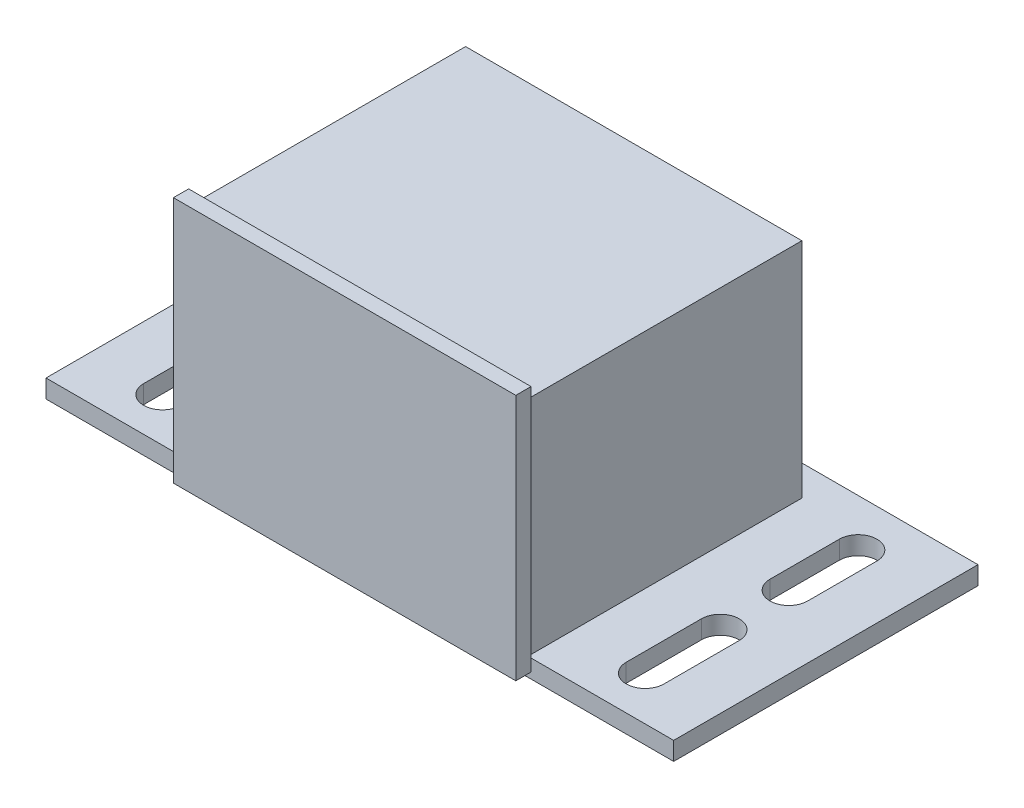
ISO-10303-21;
HEADER;
FILE_DESCRIPTION(('STEP AP214'),'2;1');
FILE_NAME('part.step','',(''),(''),'','','');
FILE_SCHEMA(('AUTOMOTIVE_DESIGN { 1 0 10303 214 1 1 1 1 }'));
ENDSEC;
DATA;
#1=APPLICATION_CONTEXT('core data for automotive mechanical design processes');
#2=APPLICATION_PROTOCOL_DEFINITION('international standard','automotive_design',2000,#1);
#3=PRODUCT_CONTEXT('',#1,'mechanical');
#4=PRODUCT('Part','Part','',(#3));
#5=PRODUCT_RELATED_PRODUCT_CATEGORY('part','',(#4));
#6=PRODUCT_DEFINITION_FORMATION('','',#4);
#7=PRODUCT_DEFINITION_CONTEXT('part definition',#1,'design');
#8=PRODUCT_DEFINITION('design','',#6,#7);
#9=PRODUCT_DEFINITION_SHAPE('','',#8);
#10=(LENGTH_UNIT() NAMED_UNIT(*) SI_UNIT(.MILLI.,.METRE.));
#11=(NAMED_UNIT(*) PLANE_ANGLE_UNIT() SI_UNIT($,.RADIAN.));
#12=(NAMED_UNIT(*) SI_UNIT($,.STERADIAN.) SOLID_ANGLE_UNIT());
#13=UNCERTAINTY_MEASURE_WITH_UNIT(LENGTH_MEASURE(1.E-05),#10,'distance_accuracy_value','');
#14=(GEOMETRIC_REPRESENTATION_CONTEXT(3) GLOBAL_UNCERTAINTY_ASSIGNED_CONTEXT((#13)) GLOBAL_UNIT_ASSIGNED_CONTEXT((#10,
#11,#12)) REPRESENTATION_CONTEXT('',''));
#15=CARTESIAN_POINT('',(0.,0.,0.));
#16=DIRECTION('',(0.,0.,1.));
#17=DIRECTION('',(1.,0.,0.));
#18=AXIS2_PLACEMENT_3D('',#15,#16,#17);
#19=CARTESIAN_POINT('',(0.,1.524,0.));
#20=DIRECTION('',(0.,-1.,0.));
#21=DIRECTION('',(0.,0.,-1.));
#22=AXIS2_PLACEMENT_3D('',#19,#20,#21);
#23=PLANE('',#22);
#24=CARTESIAN_POINT('',(20.1379240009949,1.524,-8.75426625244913));
#25=DIRECTION('',(0.,-1.,0.));
#26=DIRECTION('',(0.,0.,1.));
#27=AXIS2_PLACEMENT_3D('',#24,#25,#26);
#28=CIRCLE('',#27,1.5748);
#29=CARTESIAN_POINT('',(18.5631240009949,1.524,-8.75426625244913));
#30=VERTEX_POINT('',#29);
#31=CARTESIAN_POINT('',(21.7127240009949,1.524,-8.75426625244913));
#32=VERTEX_POINT('',#31);
#33=EDGE_CURVE('E257',#30,#32,#28,.T.);
#34=ORIENTED_EDGE('',*,*,#33,.T.);
#35=DIRECTION('',(0.,0.,1.));
#36=VECTOR('',#35,1.);
#37=CARTESIAN_POINT('',(21.7127240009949,1.524,-8.75426625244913));
#38=LINE('',#37,#36);
#39=CARTESIAN_POINT('',(21.7127240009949,1.524,-2.9652548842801));
#40=VERTEX_POINT('',#39);
#41=EDGE_CURVE('E264',#32,#40,#38,.T.);
#42=ORIENTED_EDGE('',*,*,#41,.T.);
#43=CARTESIAN_POINT('',(20.1379240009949,1.524,-2.9652548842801));
#44=DIRECTION('',(0.,-1.,0.));
#45=DIRECTION('',(0.,0.,1.));
#46=AXIS2_PLACEMENT_3D('',#43,#44,#45);
#47=CIRCLE('',#46,1.5748);
#48=CARTESIAN_POINT('',(18.5631240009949,1.524,-2.9652548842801));
#49=VERTEX_POINT('',#48);
#50=EDGE_CURVE('E277',#40,#49,#47,.T.);
#51=ORIENTED_EDGE('',*,*,#50,.T.);
#52=DIRECTION('',(0.,0.,-1.));
#53=VECTOR('',#52,1.);
#54=CARTESIAN_POINT('',(18.5631240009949,1.524,-8.75426625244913));
#55=LINE('',#54,#53);
#56=EDGE_CURVE('E274',#49,#30,#55,.T.);
#57=ORIENTED_EDGE('',*,*,#56,.T.);
#58=EDGE_LOOP('',(#34,#42,#51,#57));
#59=FACE_BOUND('',#58,.T.);
#60=DIRECTION('',(0.,0.,1.));
#61=VECTOR('',#60,1.);
#62=CARTESIAN_POINT('',(-21.7127240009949,1.524,2.7497451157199));
#63=LINE('',#62,#61);
#64=CARTESIAN_POINT('',(-21.7127240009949,1.524,2.7497451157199));
#65=VERTEX_POINT('',#64);
#66=CARTESIAN_POINT('',(-21.7127240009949,1.524,9.02822906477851));
#67=VERTEX_POINT('',#66);
#68=EDGE_CURVE('E307',#65,#67,#63,.T.);
#69=ORIENTED_EDGE('',*,*,#68,.F.);
#70=CARTESIAN_POINT('',(-20.1379240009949,1.524,2.7497451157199));
#71=DIRECTION('',(0.,1.,0.));
#72=DIRECTION('',(0.,0.,1.));
#73=AXIS2_PLACEMENT_3D('',#70,#71,#72);
#74=CIRCLE('',#73,1.5748);
#75=CARTESIAN_POINT('',(-18.5631240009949,1.524,2.7497451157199));
#76=VERTEX_POINT('',#75);
#77=EDGE_CURVE('E285',#76,#65,#74,.T.);
#78=ORIENTED_EDGE('',*,*,#77,.F.);
#79=DIRECTION('',(0.,0.,-1.));
#80=VECTOR('',#79,1.);
#81=CARTESIAN_POINT('',(-18.5631240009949,1.524,2.7497451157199));
#82=LINE('',#81,#80);
#83=CARTESIAN_POINT('',(-18.5631240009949,1.524,9.02822906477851));
#84=VERTEX_POINT('',#83);
#85=EDGE_CURVE('E296',#84,#76,#82,.T.);
#86=ORIENTED_EDGE('',*,*,#85,.F.);
#87=CARTESIAN_POINT('',(-20.1379240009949,1.524,9.02822906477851));
#88=DIRECTION('',(0.,1.,0.));
#89=DIRECTION('',(0.,0.,1.));
#90=AXIS2_PLACEMENT_3D('',#87,#88,#89);
#91=CIRCLE('',#90,1.5748);
#92=EDGE_CURVE('E310',#67,#84,#91,.T.);
#93=ORIENTED_EDGE('',*,*,#92,.F.);
#94=EDGE_LOOP('',(#69,#78,#86,#93));
#95=FACE_BOUND('',#94,.T.);
#96=DIRECTION('',(0.,0.,1.));
#97=VECTOR('',#96,1.);
#98=CARTESIAN_POINT('',(-21.7127240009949,1.524,-8.75426625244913));
#99=LINE('',#98,#97);
#100=CARTESIAN_POINT('',(-21.7127240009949,1.524,-8.75426625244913));
#101=VERTEX_POINT('',#100);
#102=CARTESIAN_POINT('',(-21.7127240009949,1.524,-2.9652548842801));
#103=VERTEX_POINT('',#102);
#104=EDGE_CURVE('E339',#101,#103,#99,.T.);
#105=ORIENTED_EDGE('',*,*,#104,.F.);
#106=CARTESIAN_POINT('',(-20.1379240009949,1.524,-8.75426625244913));
#107=DIRECTION('',(0.,1.,0.));
#108=DIRECTION('',(0.,0.,1.));
#109=AXIS2_PLACEMENT_3D('',#106,#107,#108);
#110=CIRCLE('',#109,1.5748);
#111=CARTESIAN_POINT('',(-18.5631240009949,1.524,-8.75426625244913));
#112=VERTEX_POINT('',#111);
#113=EDGE_CURVE('E317',#112,#101,#110,.T.);
#114=ORIENTED_EDGE('',*,*,#113,.F.);
#115=DIRECTION('',(0.,0.,-1.));
#116=VECTOR('',#115,1.);
#117=CARTESIAN_POINT('',(-18.5631240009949,1.524,-8.75426625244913));
#118=LINE('',#117,#116);
#119=CARTESIAN_POINT('',(-18.5631240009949,1.524,-2.9652548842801));
#120=VERTEX_POINT('',#119);
#121=EDGE_CURVE('E328',#120,#112,#118,.T.);
#122=ORIENTED_EDGE('',*,*,#121,.F.);
#123=CARTESIAN_POINT('',(-20.1379240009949,1.524,-2.9652548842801));
#124=DIRECTION('',(0.,1.,0.));
#125=DIRECTION('',(0.,0.,1.));
#126=AXIS2_PLACEMENT_3D('',#123,#124,#125);
#127=CIRCLE('',#126,1.5748);
#128=EDGE_CURVE('E342',#103,#120,#127,.T.);
#129=ORIENTED_EDGE('',*,*,#128,.F.);
#130=EDGE_LOOP('',(#105,#114,#122,#129));
#131=FACE_BOUND('',#130,.T.);
#132=DIRECTION('',(1.,0.,0.));
#133=VECTOR('',#132,1.);
#134=CARTESIAN_POINT('',(-26.19375,1.524,12.7));
#135=LINE('',#134,#133);
#136=CARTESIAN_POINT('',(-26.19375,1.524,12.7));
#137=VERTEX_POINT('',#136);
#138=CARTESIAN_POINT('',(-14.2875,1.524,12.7));
#139=VERTEX_POINT('',#138);
#140=EDGE_CURVE('E423',#137,#139,#135,.T.);
#141=ORIENTED_EDGE('',*,*,#140,.T.);
#142=CARTESIAN_POINT('',(-14.0335,1.524,12.7));
#143=VERTEX_POINT('',#142);
#144=EDGE_CURVE('E427',#139,#143,#135,.T.);
#145=ORIENTED_EDGE('',*,*,#144,.T.);
#146=DIRECTION('',(0.,0.,-1.));
#147=VECTOR('',#146,1.);
#148=CARTESIAN_POINT('',(-14.0335,1.524,0.));
#149=LINE('',#148,#147);
#150=CARTESIAN_POINT('',(-14.0335,1.524,-10.16));
#151=VERTEX_POINT('',#150);
#152=EDGE_CURVE('E411',#143,#151,#149,.T.);
#153=ORIENTED_EDGE('',*,*,#152,.T.);
#154=DIRECTION('',(1.,0.,0.));
#155=VECTOR('',#154,1.);
#156=CARTESIAN_POINT('',(0.,1.524,-10.16));
#157=LINE('',#156,#155);
#158=CARTESIAN_POINT('',(14.0335,1.524,-10.16));
#159=VERTEX_POINT('',#158);
#160=EDGE_CURVE('E406',#151,#159,#157,.T.);
#161=ORIENTED_EDGE('',*,*,#160,.T.);
#162=DIRECTION('',(0.,0.,1.));
#163=VECTOR('',#162,1.);
#164=CARTESIAN_POINT('',(14.0335,1.524,0.));
#165=LINE('',#164,#163);
#166=CARTESIAN_POINT('',(14.0335,1.524,12.7));
#167=VERTEX_POINT('',#166);
#168=EDGE_CURVE('E409',#159,#167,#165,.T.);
#169=ORIENTED_EDGE('',*,*,#168,.T.);
#170=CARTESIAN_POINT('',(14.2875,1.524,12.7));
#171=VERTEX_POINT('',#170);
#172=EDGE_CURVE('E428',#167,#171,#135,.T.);
#173=ORIENTED_EDGE('',*,*,#172,.T.);
#174=CARTESIAN_POINT('',(26.19375,1.524,12.7));
#175=VERTEX_POINT('',#174);
#176=EDGE_CURVE('E422',#171,#175,#135,.T.);
#177=ORIENTED_EDGE('',*,*,#176,.T.);
#178=DIRECTION('',(0.,0.,-1.));
#179=VECTOR('',#178,1.);
#180=CARTESIAN_POINT('',(26.19375,1.524,12.7));
#181=LINE('',#180,#179);
#182=CARTESIAN_POINT('',(26.19375,1.524,-12.7));
#183=VERTEX_POINT('',#182);
#184=EDGE_CURVE('E414',#175,#183,#181,.T.);
#185=ORIENTED_EDGE('',*,*,#184,.T.);
#186=DIRECTION('',(-1.,0.,0.));
#187=VECTOR('',#186,1.);
#188=CARTESIAN_POINT('',(-26.19375,1.524,-12.7));
#189=LINE('',#188,#187);
#190=CARTESIAN_POINT('',(-26.19375,1.524,-12.7));
#191=VERTEX_POINT('',#190);
#192=EDGE_CURVE('E417',#183,#191,#189,.T.);
#193=ORIENTED_EDGE('',*,*,#192,.T.);
#194=DIRECTION('',(0.,0.,1.));
#195=VECTOR('',#194,1.);
#196=CARTESIAN_POINT('',(-26.19375,1.524,12.7));
#197=LINE('',#196,#195);
#198=EDGE_CURVE('E420',#191,#137,#197,.T.);
#199=ORIENTED_EDGE('',*,*,#198,.T.);
#200=EDGE_LOOP('',(#141,#145,#153,#161,#169,#173,#177,#185,#193,#199));
#201=FACE_BOUND('',#200,.T.);
#202=CARTESIAN_POINT('',(20.1379240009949,1.524,2.7497451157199));
#203=DIRECTION('',(0.,-1.,0.));
#204=DIRECTION('',(0.,0.,1.));
#205=AXIS2_PLACEMENT_3D('',#202,#203,#204);
#206=CIRCLE('',#205,1.5748);
#207=CARTESIAN_POINT('',(18.5631240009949,1.524,2.7497451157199));
#208=VERTEX_POINT('',#207);
#209=CARTESIAN_POINT('',(21.7127240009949,1.524,2.7497451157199));
#210=VERTEX_POINT('',#209);
#211=EDGE_CURVE('E50',#208,#210,#206,.T.);
#212=ORIENTED_EDGE('',*,*,#211,.T.);
#213=DIRECTION('',(0.,0.,1.));
#214=VECTOR('',#213,1.);
#215=CARTESIAN_POINT('',(21.7127240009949,1.524,2.7497451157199));
#216=LINE('',#215,#214);
#217=CARTESIAN_POINT('',(21.7127240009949,1.524,9.02822906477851));
#218=VERTEX_POINT('',#217);
#219=EDGE_CURVE('E242',#210,#218,#216,.T.);
#220=ORIENTED_EDGE('',*,*,#219,.T.);
#221=CARTESIAN_POINT('',(20.1379240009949,1.524,9.02822906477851));
#222=DIRECTION('',(0.,-1.,0.));
#223=DIRECTION('',(0.,0.,1.));
#224=AXIS2_PLACEMENT_3D('',#221,#222,#223);
#225=CIRCLE('',#224,1.5748);
#226=CARTESIAN_POINT('',(18.5631240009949,1.524,9.02822906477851));
#227=VERTEX_POINT('',#226);
#228=EDGE_CURVE('E245',#218,#227,#225,.T.);
#229=ORIENTED_EDGE('',*,*,#228,.T.);
#230=DIRECTION('',(0.,0.,-1.));
#231=VECTOR('',#230,1.);
#232=CARTESIAN_POINT('',(18.5631240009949,1.524,2.7497451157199));
#233=LINE('',#232,#231);
#234=EDGE_CURVE('E251',#227,#208,#233,.T.);
#235=ORIENTED_EDGE('',*,*,#234,.T.);
#236=EDGE_LOOP('',(#212,#220,#229,#235));
#237=FACE_BOUND('',#236,.T.);
#238=ADVANCED_FACE('F33',(#59,#95,#131,#201,#237),#23,.F.);
#239=CARTESIAN_POINT('',(0.,0.,0.));
#240=DIRECTION('',(0.,-1.,0.));
#241=DIRECTION('',(0.,0.,-1.));
#242=AXIS2_PLACEMENT_3D('',#239,#240,#241);
#243=PLANE('',#242);
#244=CARTESIAN_POINT('',(-20.1379240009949,0.,2.7497451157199));
#245=DIRECTION('',(0.,1.,0.));
#246=DIRECTION('',(0.,0.,1.));
#247=AXIS2_PLACEMENT_3D('',#244,#245,#246);
#248=CIRCLE('',#247,1.5748);
#249=CARTESIAN_POINT('',(-18.5631240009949,0.,2.7497451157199));
#250=VERTEX_POINT('',#249);
#251=CARTESIAN_POINT('',(-21.7127240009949,0.,2.7497451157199));
#252=VERTEX_POINT('',#251);
#253=EDGE_CURVE('E292',#250,#252,#248,.T.);
#254=ORIENTED_EDGE('',*,*,#253,.T.);
#255=DIRECTION('',(0.,0.,1.));
#256=VECTOR('',#255,1.);
#257=CARTESIAN_POINT('',(-21.7127240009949,0.,2.7497451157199));
#258=LINE('',#257,#256);
#259=CARTESIAN_POINT('',(-21.7127240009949,0.,9.02822906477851));
#260=VERTEX_POINT('',#259);
#261=EDGE_CURVE('E295',#252,#260,#258,.T.);
#262=ORIENTED_EDGE('',*,*,#261,.T.);
#263=CARTESIAN_POINT('',(-20.1379240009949,0.,9.02822906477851));
#264=DIRECTION('',(0.,1.,0.));
#265=DIRECTION('',(0.,0.,1.));
#266=AXIS2_PLACEMENT_3D('',#263,#264,#265);
#267=CIRCLE('',#266,1.5748);
#268=CARTESIAN_POINT('',(-18.5631240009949,0.,9.02822906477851));
#269=VERTEX_POINT('',#268);
#270=EDGE_CURVE('E299',#260,#269,#267,.T.);
#271=ORIENTED_EDGE('',*,*,#270,.T.);
#272=DIRECTION('',(0.,0.,-1.));
#273=VECTOR('',#272,1.);
#274=CARTESIAN_POINT('',(-18.5631240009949,0.,2.7497451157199));
#275=LINE('',#274,#273);
#276=EDGE_CURVE('E302',#269,#250,#275,.T.);
#277=ORIENTED_EDGE('',*,*,#276,.T.);
#278=EDGE_LOOP('',(#254,#262,#271,#277));
#279=FACE_BOUND('',#278,.T.);
#280=CARTESIAN_POINT('',(-20.1379240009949,0.,-8.75426625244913));
#281=DIRECTION('',(0.,1.,0.));
#282=DIRECTION('',(0.,0.,1.));
#283=AXIS2_PLACEMENT_3D('',#280,#281,#282);
#284=CIRCLE('',#283,1.5748);
#285=CARTESIAN_POINT('',(-18.5631240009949,0.,-8.75426625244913));
#286=VERTEX_POINT('',#285);
#287=CARTESIAN_POINT('',(-21.7127240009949,0.,-8.75426625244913));
#288=VERTEX_POINT('',#287);
#289=EDGE_CURVE('E324',#286,#288,#284,.T.);
#290=ORIENTED_EDGE('',*,*,#289,.T.);
#291=DIRECTION('',(0.,0.,1.));
#292=VECTOR('',#291,1.);
#293=CARTESIAN_POINT('',(-21.7127240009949,0.,-8.75426625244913));
#294=LINE('',#293,#292);
#295=CARTESIAN_POINT('',(-21.7127240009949,0.,-2.9652548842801));
#296=VERTEX_POINT('',#295);
#297=EDGE_CURVE('E327',#288,#296,#294,.T.);
#298=ORIENTED_EDGE('',*,*,#297,.T.);
#299=CARTESIAN_POINT('',(-20.1379240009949,0.,-2.9652548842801));
#300=DIRECTION('',(0.,1.,0.));
#301=DIRECTION('',(0.,0.,1.));
#302=AXIS2_PLACEMENT_3D('',#299,#300,#301);
#303=CIRCLE('',#302,1.5748);
#304=CARTESIAN_POINT('',(-18.5631240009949,0.,-2.9652548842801));
#305=VERTEX_POINT('',#304);
#306=EDGE_CURVE('E331',#296,#305,#303,.T.);
#307=ORIENTED_EDGE('',*,*,#306,.T.);
#308=DIRECTION('',(0.,0.,-1.));
#309=VECTOR('',#308,1.);
#310=CARTESIAN_POINT('',(-18.5631240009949,0.,-8.75426625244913));
#311=LINE('',#310,#309);
#312=EDGE_CURVE('E334',#305,#286,#311,.T.);
#313=ORIENTED_EDGE('',*,*,#312,.T.);
#314=EDGE_LOOP('',(#290,#298,#307,#313));
#315=FACE_BOUND('',#314,.T.);
#316=DIRECTION('',(0.,0.,-1.));
#317=VECTOR('',#316,1.);
#318=CARTESIAN_POINT('',(26.19375,0.,12.7));
#319=LINE('',#318,#317);
#320=CARTESIAN_POINT('',(26.19375,0.,12.7));
#321=VERTEX_POINT('',#320);
#322=CARTESIAN_POINT('',(26.19375,0.,-12.7));
#323=VERTEX_POINT('',#322);
#324=EDGE_CURVE('E413',#321,#323,#319,.T.);
#325=ORIENTED_EDGE('',*,*,#324,.F.);
#326=DIRECTION('',(1.,0.,0.));
#327=VECTOR('',#326,1.);
#328=CARTESIAN_POINT('',(-26.19375,0.,12.7));
#329=LINE('',#328,#327);
#330=CARTESIAN_POINT('',(-26.19375,0.,12.7));
#331=VERTEX_POINT('',#330);
#332=EDGE_CURVE('E418',#331,#321,#329,.T.);
#333=ORIENTED_EDGE('',*,*,#332,.F.);
#334=DIRECTION('',(0.,0.,1.));
#335=VECTOR('',#334,1.);
#336=CARTESIAN_POINT('',(-26.19375,0.,12.7));
#337=LINE('',#336,#335);
#338=CARTESIAN_POINT('',(-26.19375,0.,-12.7));
#339=VERTEX_POINT('',#338);
#340=EDGE_CURVE('E433',#339,#331,#337,.T.);
#341=ORIENTED_EDGE('',*,*,#340,.F.);
#342=DIRECTION('',(-1.,0.,0.));
#343=VECTOR('',#342,1.);
#344=CARTESIAN_POINT('',(-26.19375,0.,-12.7));
#345=LINE('',#344,#343);
#346=EDGE_CURVE('E431',#323,#339,#345,.T.);
#347=ORIENTED_EDGE('',*,*,#346,.F.);
#348=EDGE_LOOP('',(#325,#333,#341,#347));
#349=FACE_BOUND('',#348,.T.);
#350=DIRECTION('',(0.,0.,1.));
#351=VECTOR('',#350,1.);
#352=CARTESIAN_POINT('',(21.7127240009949,0.,-8.75426625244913));
#353=LINE('',#352,#351);
#354=CARTESIAN_POINT('',(21.7127240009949,0.,-8.75426625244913));
#355=VERTEX_POINT('',#354);
#356=CARTESIAN_POINT('',(21.7127240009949,0.,-2.9652548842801));
#357=VERTEX_POINT('',#356);
#358=EDGE_CURVE('E269',#355,#357,#353,.T.);
#359=ORIENTED_EDGE('',*,*,#358,.F.);
#360=CARTESIAN_POINT('',(20.1379240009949,0.,-8.75426625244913));
#361=DIRECTION('',(0.,-1.,0.));
#362=DIRECTION('',(0.,0.,1.));
#363=AXIS2_PLACEMENT_3D('',#360,#361,#362);
#364=CIRCLE('',#363,1.5748);
#365=CARTESIAN_POINT('',(18.5631240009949,0.,-8.75426625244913));
#366=VERTEX_POINT('',#365);
#367=EDGE_CURVE('E261',#366,#355,#364,.T.);
#368=ORIENTED_EDGE('',*,*,#367,.F.);
#369=DIRECTION('',(0.,0.,-1.));
#370=VECTOR('',#369,1.);
#371=CARTESIAN_POINT('',(18.5631240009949,0.,-8.75426625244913));
#372=LINE('',#371,#370);
#373=CARTESIAN_POINT('',(18.5631240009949,0.,-2.9652548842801));
#374=VERTEX_POINT('',#373);
#375=EDGE_CURVE('E263',#374,#366,#372,.T.);
#376=ORIENTED_EDGE('',*,*,#375,.F.);
#377=CARTESIAN_POINT('',(20.1379240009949,0.,-2.9652548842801));
#378=DIRECTION('',(0.,-1.,0.));
#379=DIRECTION('',(0.,0.,1.));
#380=AXIS2_PLACEMENT_3D('',#377,#378,#379);
#381=CIRCLE('',#380,1.5748);
#382=EDGE_CURVE('E266',#357,#374,#381,.T.);
#383=ORIENTED_EDGE('',*,*,#382,.F.);
#384=EDGE_LOOP('',(#359,#368,#376,#383));
#385=FACE_BOUND('',#384,.T.);
#386=DIRECTION('',(0.,0.,1.));
#387=VECTOR('',#386,1.);
#388=CARTESIAN_POINT('',(21.7127240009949,0.,2.7497451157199));
#389=LINE('',#388,#387);
#390=CARTESIAN_POINT('',(21.7127240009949,0.,2.7497451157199));
#391=VERTEX_POINT('',#390);
#392=CARTESIAN_POINT('',(21.7127240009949,0.,9.02822906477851));
#393=VERTEX_POINT('',#392);
#394=EDGE_CURVE('E238',#391,#393,#389,.T.);
#395=ORIENTED_EDGE('',*,*,#394,.F.);
#396=CARTESIAN_POINT('',(20.1379240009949,0.,2.7497451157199));
#397=DIRECTION('',(0.,-1.,0.));
#398=DIRECTION('',(0.,0.,1.));
#399=AXIS2_PLACEMENT_3D('',#396,#397,#398);
#400=CIRCLE('',#399,1.5748);
#401=CARTESIAN_POINT('',(18.5631240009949,0.,2.7497451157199));
#402=VERTEX_POINT('',#401);
#403=EDGE_CURVE('E234',#402,#391,#400,.T.);
#404=ORIENTED_EDGE('',*,*,#403,.F.);
#405=DIRECTION('',(0.,0.,-1.));
#406=VECTOR('',#405,1.);
#407=CARTESIAN_POINT('',(18.5631240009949,0.,2.7497451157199));
#408=LINE('',#407,#406);
#409=CARTESIAN_POINT('',(18.5631240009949,0.,9.02822906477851));
#410=VERTEX_POINT('',#409);
#411=EDGE_CURVE('E226',#410,#402,#408,.T.);
#412=ORIENTED_EDGE('',*,*,#411,.F.);
#413=CARTESIAN_POINT('',(20.1379240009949,0.,9.02822906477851));
#414=DIRECTION('',(0.,-1.,0.));
#415=DIRECTION('',(0.,0.,1.));
#416=AXIS2_PLACEMENT_3D('',#413,#414,#415);
#417=CIRCLE('',#416,1.5748);
#418=EDGE_CURVE('E233',#393,#410,#417,.T.);
#419=ORIENTED_EDGE('',*,*,#418,.F.);
#420=EDGE_LOOP('',(#395,#404,#412,#419));
#421=FACE_BOUND('',#420,.T.);
#422=ADVANCED_FACE('F241',(#279,#315,#349,#385,#421),#243,.T.);
#423=CARTESIAN_POINT('',(-26.19375,1.524,12.7));
#424=DIRECTION('',(0.,0.,-1.));
#425=DIRECTION('',(-1.,0.,0.));
#426=AXIS2_PLACEMENT_3D('',#423,#424,#425);
#427=PLANE('',#426);
#428=DIRECTION('',(0.,-1.,0.));
#429=VECTOR('',#428,1.);
#430=CARTESIAN_POINT('',(-14.2875,21.1455,12.7));
#431=LINE('',#430,#429);
#432=CARTESIAN_POINT('',(-14.2875,0.508,12.7));
#433=VERTEX_POINT('',#432);
#434=EDGE_CURVE('E11',#139,#433,#431,.T.);
#435=ORIENTED_EDGE('',*,*,#434,.F.);
#436=ORIENTED_EDGE('',*,*,#140,.F.);
#437=DIRECTION('',(0.,-1.,0.));
#438=VECTOR('',#437,1.);
#439=CARTESIAN_POINT('',(-26.19375,1.524,12.7));
#440=LINE('',#439,#438);
#441=EDGE_CURVE('E438',#137,#331,#440,.T.);
#442=ORIENTED_EDGE('',*,*,#441,.T.);
#443=ORIENTED_EDGE('',*,*,#332,.T.);
#444=DIRECTION('',(0.,-1.,0.));
#445=VECTOR('',#444,1.);
#446=CARTESIAN_POINT('',(26.19375,1.524,12.7));
#447=LINE('',#446,#445);
#448=EDGE_CURVE('E426',#175,#321,#447,.T.);
#449=ORIENTED_EDGE('',*,*,#448,.F.);
#450=ORIENTED_EDGE('',*,*,#176,.F.);
#451=DIRECTION('',(0.,1.,0.));
#452=VECTOR('',#451,1.);
#453=CARTESIAN_POINT('',(14.2875,21.1455,12.7));
#454=LINE('',#453,#452);
#455=CARTESIAN_POINT('',(14.2875,0.508,12.7));
#456=VERTEX_POINT('',#455);
#457=EDGE_CURVE('E371',#456,#171,#454,.T.);
#458=ORIENTED_EDGE('',*,*,#457,.F.);
#459=DIRECTION('',(1.,0.,0.));
#460=VECTOR('',#459,1.);
#461=CARTESIAN_POINT('',(-14.2875,0.508,12.7));
#462=LINE('',#461,#460);
#463=EDGE_CURVE('E367',#433,#456,#462,.T.);
#464=ORIENTED_EDGE('',*,*,#463,.F.);
#465=EDGE_LOOP('',(#435,#436,#442,#443,#449,#450,#458,#464));
#466=FACE_BOUND('',#465,.T.);
#467=ADVANCED_FACE('F461',(#466),#427,.F.);
#468=CARTESIAN_POINT('',(26.19375,1.524,12.7));
#469=DIRECTION('',(-1.,0.,0.));
#470=DIRECTION('',(0.,0.,1.));
#471=AXIS2_PLACEMENT_3D('',#468,#469,#470);
#472=PLANE('',#471);
#473=ORIENTED_EDGE('',*,*,#324,.T.);
#474=DIRECTION('',(0.,-1.,0.));
#475=VECTOR('',#474,1.);
#476=CARTESIAN_POINT('',(26.19375,1.524,-12.7));
#477=LINE('',#476,#475);
#478=EDGE_CURVE('E37',#183,#323,#477,.T.);
#479=ORIENTED_EDGE('',*,*,#478,.F.);
#480=ORIENTED_EDGE('',*,*,#184,.F.);
#481=ORIENTED_EDGE('',*,*,#448,.T.);
#482=EDGE_LOOP('',(#473,#479,#480,#481));
#483=FACE_BOUND('',#482,.T.);
#484=ADVANCED_FACE('F35',(#483),#472,.F.);
#485=CARTESIAN_POINT('',(-26.19375,1.524,-12.7));
#486=DIRECTION('',(0.,0.,1.));
#487=DIRECTION('',(1.,0.,0.));
#488=AXIS2_PLACEMENT_3D('',#485,#486,#487);
#489=PLANE('',#488);
#490=ORIENTED_EDGE('',*,*,#346,.T.);
#491=DIRECTION('',(0.,-1.,0.));
#492=VECTOR('',#491,1.);
#493=CARTESIAN_POINT('',(-26.19375,1.524,-12.7));
#494=LINE('',#493,#492);
#495=EDGE_CURVE('E440',#191,#339,#494,.T.);
#496=ORIENTED_EDGE('',*,*,#495,.F.);
#497=ORIENTED_EDGE('',*,*,#192,.F.);
#498=ORIENTED_EDGE('',*,*,#478,.T.);
#499=EDGE_LOOP('',(#490,#496,#497,#498));
#500=FACE_BOUND('',#499,.T.);
#501=ADVANCED_FACE('F449',(#500),#489,.F.);
#502=CARTESIAN_POINT('',(-26.19375,1.524,12.7));
#503=DIRECTION('',(1.,0.,0.));
#504=DIRECTION('',(0.,0.,-1.));
#505=AXIS2_PLACEMENT_3D('',#502,#503,#504);
#506=PLANE('',#505);
#507=ORIENTED_EDGE('',*,*,#340,.T.);
#508=ORIENTED_EDGE('',*,*,#441,.F.);
#509=ORIENTED_EDGE('',*,*,#198,.F.);
#510=ORIENTED_EDGE('',*,*,#495,.T.);
#511=EDGE_LOOP('',(#507,#508,#509,#510));
#512=FACE_BOUND('',#511,.T.);
#513=ADVANCED_FACE('F458',(#512),#506,.F.);
#514=CARTESIAN_POINT('',(-14.0335,0.,-10.16));
#515=DIRECTION('',(-1.,0.,0.));
#516=DIRECTION('',(0.,0.,1.));
#517=AXIS2_PLACEMENT_3D('',#514,#515,#516);
#518=PLANE('',#517);
#519=ORIENTED_EDGE('',*,*,#152,.F.);
#520=DIRECTION('',(0.,-1.,0.));
#521=VECTOR('',#520,1.);
#522=CARTESIAN_POINT('',(-14.0335,0.,12.7));
#523=LINE('',#522,#521);
#524=CARTESIAN_POINT('',(-14.0335,20.1295,12.7));
#525=VERTEX_POINT('',#524);
#526=EDGE_CURVE('E386',#525,#143,#523,.T.);
#527=ORIENTED_EDGE('',*,*,#526,.F.);
#528=DIRECTION('',(0.,0.,1.));
#529=VECTOR('',#528,1.);
#530=CARTESIAN_POINT('',(-14.0335,20.1295,-10.16));
#531=LINE('',#530,#529);
#532=CARTESIAN_POINT('',(-14.0335,20.1295,-10.16));
#533=VERTEX_POINT('',#532);
#534=EDGE_CURVE('E404',#533,#525,#531,.T.);
#535=ORIENTED_EDGE('',*,*,#534,.F.);
#536=DIRECTION('',(0.,-1.,0.));
#537=VECTOR('',#536,1.);
#538=CARTESIAN_POINT('',(-14.0335,0.,-10.16));
#539=LINE('',#538,#537);
#540=EDGE_CURVE('E387',#533,#151,#539,.T.);
#541=ORIENTED_EDGE('',*,*,#540,.T.);
#542=EDGE_LOOP('',(#519,#527,#535,#541));
#543=FACE_BOUND('',#542,.T.);
#544=ADVANCED_FACE('F511',(#543),#518,.T.);
#545=CARTESIAN_POINT('',(14.0335,0.,-10.16));
#546=DIRECTION('',(1.,0.,0.));
#547=DIRECTION('',(0.,0.,-1.));
#548=AXIS2_PLACEMENT_3D('',#545,#546,#547);
#549=PLANE('',#548);
#550=ORIENTED_EDGE('',*,*,#168,.F.);
#551=DIRECTION('',(0.,1.,0.));
#552=VECTOR('',#551,1.);
#553=CARTESIAN_POINT('',(14.0335,0.,-10.16));
#554=LINE('',#553,#552);
#555=CARTESIAN_POINT('',(14.0335,20.1295,-10.16));
#556=VERTEX_POINT('',#555);
#557=EDGE_CURVE('E390',#159,#556,#554,.T.);
#558=ORIENTED_EDGE('',*,*,#557,.T.);
#559=DIRECTION('',(0.,0.,1.));
#560=VECTOR('',#559,1.);
#561=CARTESIAN_POINT('',(14.0335,20.1295,-10.16));
#562=LINE('',#561,#560);
#563=CARTESIAN_POINT('',(14.0335,20.1295,12.7));
#564=VERTEX_POINT('',#563);
#565=EDGE_CURVE('E396',#556,#564,#562,.T.);
#566=ORIENTED_EDGE('',*,*,#565,.T.);
#567=DIRECTION('',(0.,1.,0.));
#568=VECTOR('',#567,1.);
#569=CARTESIAN_POINT('',(14.0335,0.,12.7));
#570=LINE('',#569,#568);
#571=EDGE_CURVE('E399',#167,#564,#570,.T.);
#572=ORIENTED_EDGE('',*,*,#571,.F.);
#573=EDGE_LOOP('',(#550,#558,#566,#572));
#574=FACE_BOUND('',#573,.T.);
#575=ADVANCED_FACE('F760',(#574),#549,.T.);
#576=CARTESIAN_POINT('',(0.,0.,-10.16));
#577=DIRECTION('',(0.,0.,-1.));
#578=DIRECTION('',(-1.,0.,0.));
#579=AXIS2_PLACEMENT_3D('',#576,#577,#578);
#580=PLANE('',#579);
#581=ORIENTED_EDGE('',*,*,#160,.F.);
#582=ORIENTED_EDGE('',*,*,#540,.F.);
#583=DIRECTION('',(-1.,0.,0.));
#584=VECTOR('',#583,1.);
#585=CARTESIAN_POINT('',(-14.0335,20.1295,-10.16));
#586=LINE('',#585,#584);
#587=EDGE_CURVE('E393',#556,#533,#586,.T.);
#588=ORIENTED_EDGE('',*,*,#587,.F.);
#589=ORIENTED_EDGE('',*,*,#557,.F.);
#590=EDGE_LOOP('',(#581,#582,#588,#589));
#591=FACE_BOUND('',#590,.T.);
#592=ADVANCED_FACE('F751',(#591),#580,.T.);
#593=CARTESIAN_POINT('',(-14.0335,20.1295,-10.16));
#594=DIRECTION('',(0.,1.,0.));
#595=DIRECTION('',(0.,0.,1.));
#596=AXIS2_PLACEMENT_3D('',#593,#594,#595);
#597=PLANE('',#596);
#598=DIRECTION('',(-1.,0.,0.));
#599=VECTOR('',#598,1.);
#600=CARTESIAN_POINT('',(-14.0335,20.1295,12.7));
#601=LINE('',#600,#599);
#602=EDGE_CURVE('E391',#564,#525,#601,.T.);
#603=ORIENTED_EDGE('',*,*,#602,.F.);
#604=ORIENTED_EDGE('',*,*,#565,.F.);
#605=ORIENTED_EDGE('',*,*,#587,.T.);
#606=ORIENTED_EDGE('',*,*,#534,.T.);
#607=EDGE_LOOP('',(#603,#604,#605,#606));
#608=FACE_BOUND('',#607,.T.);
#609=ADVANCED_FACE('F737',(#608),#597,.T.);
#610=CARTESIAN_POINT('',(-14.2875,21.1455,13.97));
#611=DIRECTION('',(1.,0.,0.));
#612=DIRECTION('',(0.,1.,0.));
#613=AXIS2_PLACEMENT_3D('',#610,#611,#612);
#614=PLANE('',#613);
#615=CARTESIAN_POINT('',(-14.2875,21.1455,12.7));
#616=VERTEX_POINT('',#615);
#617=EDGE_CURVE('E43',#616,#139,#431,.T.);
#618=ORIENTED_EDGE('',*,*,#617,.T.);
#619=ORIENTED_EDGE('',*,*,#434,.T.);
#620=DIRECTION('',(0.,0.,-1.));
#621=VECTOR('',#620,1.);
#622=CARTESIAN_POINT('',(-14.2875,0.508,13.97));
#623=LINE('',#622,#621);
#624=CARTESIAN_POINT('',(-14.2875,0.508,13.97));
#625=VERTEX_POINT('',#624);
#626=EDGE_CURVE('E383',#625,#433,#623,.T.);
#627=ORIENTED_EDGE('',*,*,#626,.F.);
#628=DIRECTION('',(0.,-1.,0.));
#629=VECTOR('',#628,1.);
#630=CARTESIAN_POINT('',(-14.2875,21.1455,13.97));
#631=LINE('',#630,#629);
#632=CARTESIAN_POINT('',(-14.2875,21.1455,13.97));
#633=VERTEX_POINT('',#632);
#634=EDGE_CURVE('E355',#633,#625,#631,.T.);
#635=ORIENTED_EDGE('',*,*,#634,.F.);
#636=DIRECTION('',(0.,0.,-1.));
#637=VECTOR('',#636,1.);
#638=CARTESIAN_POINT('',(-14.2875,21.1455,13.97));
#639=LINE('',#638,#637);
#640=EDGE_CURVE('E364',#633,#616,#639,.T.);
#641=ORIENTED_EDGE('',*,*,#640,.T.);
#642=EDGE_LOOP('',(#618,#619,#627,#635,#641));
#643=FACE_BOUND('',#642,.T.);
#644=ADVANCED_FACE('F473',(#643),#614,.F.);
#645=CARTESIAN_POINT('',(-14.2875,0.508,13.97));
#646=DIRECTION('',(0.,1.,0.));
#647=DIRECTION('',(0.,0.,1.));
#648=AXIS2_PLACEMENT_3D('',#645,#646,#647);
#649=PLANE('',#648);
#650=ORIENTED_EDGE('',*,*,#463,.T.);
#651=DIRECTION('',(0.,0.,-1.));
#652=VECTOR('',#651,1.);
#653=CARTESIAN_POINT('',(14.2875,0.508,13.97));
#654=LINE('',#653,#652);
#655=CARTESIAN_POINT('',(14.2875,0.508,13.97));
#656=VERTEX_POINT('',#655);
#657=EDGE_CURVE('E380',#656,#456,#654,.T.);
#658=ORIENTED_EDGE('',*,*,#657,.F.);
#659=DIRECTION('',(1.,0.,0.));
#660=VECTOR('',#659,1.);
#661=CARTESIAN_POINT('',(-14.2875,0.508,13.97));
#662=LINE('',#661,#660);
#663=EDGE_CURVE('E358',#625,#656,#662,.T.);
#664=ORIENTED_EDGE('',*,*,#663,.F.);
#665=ORIENTED_EDGE('',*,*,#626,.T.);
#666=EDGE_LOOP('',(#650,#658,#664,#665));
#667=FACE_BOUND('',#666,.T.);
#668=ADVANCED_FACE('F488',(#667),#649,.F.);
#669=CARTESIAN_POINT('',(14.2875,21.1455,13.97));
#670=DIRECTION('',(-1.,0.,0.));
#671=DIRECTION('',(0.,-1.,0.));
#672=AXIS2_PLACEMENT_3D('',#669,#670,#671);
#673=PLANE('',#672);
#674=ORIENTED_EDGE('',*,*,#457,.T.);
#675=CARTESIAN_POINT('',(14.2875,21.1455,12.7));
#676=VERTEX_POINT('',#675);
#677=EDGE_CURVE('E370',#171,#676,#454,.T.);
#678=ORIENTED_EDGE('',*,*,#677,.T.);
#679=DIRECTION('',(0.,0.,-1.));
#680=VECTOR('',#679,1.);
#681=CARTESIAN_POINT('',(14.2875,21.1455,13.97));
#682=LINE('',#681,#680);
#683=CARTESIAN_POINT('',(14.2875,21.1455,13.97));
#684=VERTEX_POINT('',#683);
#685=EDGE_CURVE('E377',#684,#676,#682,.T.);
#686=ORIENTED_EDGE('',*,*,#685,.F.);
#687=DIRECTION('',(0.,1.,0.));
#688=VECTOR('',#687,1.);
#689=CARTESIAN_POINT('',(14.2875,21.1455,13.97));
#690=LINE('',#689,#688);
#691=EDGE_CURVE('E361',#656,#684,#690,.T.);
#692=ORIENTED_EDGE('',*,*,#691,.F.);
#693=ORIENTED_EDGE('',*,*,#657,.T.);
#694=EDGE_LOOP('',(#674,#678,#686,#692,#693));
#695=FACE_BOUND('',#694,.T.);
#696=ADVANCED_FACE('F484',(#695),#673,.F.);
#697=CARTESIAN_POINT('',(-14.2875,21.1455,13.97));
#698=DIRECTION('',(0.,-1.,0.));
#699=DIRECTION('',(0.,0.,-1.));
#700=AXIS2_PLACEMENT_3D('',#697,#698,#699);
#701=PLANE('',#700);
#702=DIRECTION('',(-1.,0.,0.));
#703=VECTOR('',#702,1.);
#704=CARTESIAN_POINT('',(-14.2875,21.1455,12.7));
#705=LINE('',#704,#703);
#706=EDGE_CURVE('E359',#676,#616,#705,.T.);
#707=ORIENTED_EDGE('',*,*,#706,.T.);
#708=ORIENTED_EDGE('',*,*,#640,.F.);
#709=DIRECTION('',(-1.,0.,0.));
#710=VECTOR('',#709,1.);
#711=CARTESIAN_POINT('',(-14.2875,21.1455,13.97));
#712=LINE('',#711,#710);
#713=EDGE_CURVE('E363',#684,#633,#712,.T.);
#714=ORIENTED_EDGE('',*,*,#713,.F.);
#715=ORIENTED_EDGE('',*,*,#685,.T.);
#716=EDGE_LOOP('',(#707,#708,#714,#715));
#717=FACE_BOUND('',#716,.T.);
#718=ADVANCED_FACE('F479',(#717),#701,.F.);
#719=CARTESIAN_POINT('',(0.,0.,13.97));
#720=DIRECTION('',(0.,0.,1.));
#721=DIRECTION('',(1.,0.,0.));
#722=AXIS2_PLACEMENT_3D('',#719,#720,#721);
#723=PLANE('',#722);
#724=ORIENTED_EDGE('',*,*,#634,.T.);
#725=ORIENTED_EDGE('',*,*,#663,.T.);
#726=ORIENTED_EDGE('',*,*,#691,.T.);
#727=ORIENTED_EDGE('',*,*,#713,.T.);
#728=EDGE_LOOP('',(#724,#725,#726,#727));
#729=FACE_BOUND('',#728,.T.);
#730=ADVANCED_FACE('F490',(#729),#723,.T.);
#731=CARTESIAN_POINT('',(0.,0.,12.7));
#732=DIRECTION('',(0.,0.,1.));
#733=DIRECTION('',(1.,0.,0.));
#734=AXIS2_PLACEMENT_3D('',#731,#732,#733);
#735=PLANE('',#734);
#736=ORIENTED_EDGE('',*,*,#172,.F.);
#737=ORIENTED_EDGE('',*,*,#571,.T.);
#738=ORIENTED_EDGE('',*,*,#602,.T.);
#739=ORIENTED_EDGE('',*,*,#526,.T.);
#740=ORIENTED_EDGE('',*,*,#144,.F.);
#741=ORIENTED_EDGE('',*,*,#617,.F.);
#742=ORIENTED_EDGE('',*,*,#706,.F.);
#743=ORIENTED_EDGE('',*,*,#677,.F.);
#744=EDGE_LOOP('',(#736,#737,#738,#739,#740,#741,#742,#743));
#745=FACE_BOUND('',#744,.T.);
#746=ADVANCED_FACE('F469',(#745),#735,.F.);
#747=CARTESIAN_POINT('',(-20.1379240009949,0.,-8.75426625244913));
#748=DIRECTION('',(0.,1.,0.));
#749=DIRECTION('',(0.,0.,1.));
#750=AXIS2_PLACEMENT_3D('',#747,#748,#749);
#751=CYLINDRICAL_SURFACE('',#750,1.5748);
#752=ORIENTED_EDGE('',*,*,#113,.T.);
#753=DIRECTION('',(0.,1.,0.));
#754=VECTOR('',#753,1.);
#755=CARTESIAN_POINT('',(-21.7127240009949,0.,-8.75426625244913));
#756=LINE('',#755,#754);
#757=EDGE_CURVE('E337',#288,#101,#756,.T.);
#758=ORIENTED_EDGE('',*,*,#757,.F.);
#759=ORIENTED_EDGE('',*,*,#289,.F.);
#760=DIRECTION('',(0.,1.,0.));
#761=VECTOR('',#760,1.);
#762=CARTESIAN_POINT('',(-18.5631240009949,0.,-8.75426625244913));
#763=LINE('',#762,#761);
#764=EDGE_CURVE('E347',#286,#112,#763,.T.);
#765=ORIENTED_EDGE('',*,*,#764,.T.);
#766=EDGE_LOOP('',(#752,#758,#759,#765));
#767=FACE_BOUND('',#766,.T.);
#768=ADVANCED_FACE('F497',(#767),#751,.F.);
#769=CARTESIAN_POINT('',(-18.5631240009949,0.,-8.75426625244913));
#770=DIRECTION('',(1.,0.,0.));
#771=DIRECTION('',(0.,0.,-1.));
#772=AXIS2_PLACEMENT_3D('',#769,#770,#771);
#773=PLANE('',#772);
#774=ORIENTED_EDGE('',*,*,#121,.T.);
#775=ORIENTED_EDGE('',*,*,#764,.F.);
#776=ORIENTED_EDGE('',*,*,#312,.F.);
#777=DIRECTION('',(0.,1.,0.));
#778=VECTOR('',#777,1.);
#779=CARTESIAN_POINT('',(-18.5631240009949,0.,-2.9652548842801));
#780=LINE('',#779,#778);
#781=EDGE_CURVE('E349',#305,#120,#780,.T.);
#782=ORIENTED_EDGE('',*,*,#781,.T.);
#783=EDGE_LOOP('',(#774,#775,#776,#782));
#784=FACE_BOUND('',#783,.T.);
#785=ADVANCED_FACE('F635',(#784),#773,.F.);
#786=CARTESIAN_POINT('',(-20.1379240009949,0.,-2.9652548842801));
#787=DIRECTION('',(0.,1.,0.));
#788=DIRECTION('',(0.,0.,1.));
#789=AXIS2_PLACEMENT_3D('',#786,#787,#788);
#790=CYLINDRICAL_SURFACE('',#789,1.5748);
#791=ORIENTED_EDGE('',*,*,#128,.T.);
#792=ORIENTED_EDGE('',*,*,#781,.F.);
#793=ORIENTED_EDGE('',*,*,#306,.F.);
#794=DIRECTION('',(0.,1.,0.));
#795=VECTOR('',#794,1.);
#796=CARTESIAN_POINT('',(-21.7127240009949,0.,-2.9652548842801));
#797=LINE('',#796,#795);
#798=EDGE_CURVE('E351',#296,#103,#797,.T.);
#799=ORIENTED_EDGE('',*,*,#798,.T.);
#800=EDGE_LOOP('',(#791,#792,#793,#799));
#801=FACE_BOUND('',#800,.T.);
#802=ADVANCED_FACE('F638',(#801),#790,.F.);
#803=CARTESIAN_POINT('',(-21.7127240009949,0.,-8.75426625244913));
#804=DIRECTION('',(-1.,0.,0.));
#805=DIRECTION('',(0.,0.,1.));
#806=AXIS2_PLACEMENT_3D('',#803,#804,#805);
#807=PLANE('',#806);
#808=ORIENTED_EDGE('',*,*,#104,.T.);
#809=ORIENTED_EDGE('',*,*,#798,.F.);
#810=ORIENTED_EDGE('',*,*,#297,.F.);
#811=ORIENTED_EDGE('',*,*,#757,.T.);
#812=EDGE_LOOP('',(#808,#809,#810,#811));
#813=FACE_BOUND('',#812,.T.);
#814=ADVANCED_FACE('F633',(#813),#807,.F.);
#815=CARTESIAN_POINT('',(-20.1379240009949,0.,2.7497451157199));
#816=DIRECTION('',(0.,1.,0.));
#817=DIRECTION('',(0.,0.,1.));
#818=AXIS2_PLACEMENT_3D('',#815,#816,#817);
#819=CYLINDRICAL_SURFACE('',#818,1.5748);
#820=ORIENTED_EDGE('',*,*,#77,.T.);
#821=DIRECTION('',(0.,1.,0.));
#822=VECTOR('',#821,1.);
#823=CARTESIAN_POINT('',(-21.7127240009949,0.,2.7497451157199));
#824=LINE('',#823,#822);
#825=EDGE_CURVE('E305',#252,#65,#824,.T.);
#826=ORIENTED_EDGE('',*,*,#825,.F.);
#827=ORIENTED_EDGE('',*,*,#253,.F.);
#828=DIRECTION('',(0.,1.,0.));
#829=VECTOR('',#828,1.);
#830=CARTESIAN_POINT('',(-18.5631240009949,0.,2.7497451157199));
#831=LINE('',#830,#829);
#832=EDGE_CURVE('E315',#250,#76,#831,.T.);
#833=ORIENTED_EDGE('',*,*,#832,.T.);
#834=EDGE_LOOP('',(#820,#826,#827,#833));
#835=FACE_BOUND('',#834,.T.);
#836=ADVANCED_FACE('F624',(#835),#819,.F.);
#837=CARTESIAN_POINT('',(-18.5631240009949,0.,2.7497451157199));
#838=DIRECTION('',(1.,0.,0.));
#839=DIRECTION('',(0.,0.,-1.));
#840=AXIS2_PLACEMENT_3D('',#837,#838,#839);
#841=PLANE('',#840);
#842=ORIENTED_EDGE('',*,*,#85,.T.);
#843=ORIENTED_EDGE('',*,*,#832,.F.);
#844=ORIENTED_EDGE('',*,*,#276,.F.);
#845=DIRECTION('',(0.,1.,0.));
#846=VECTOR('',#845,1.);
#847=CARTESIAN_POINT('',(-18.5631240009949,0.,9.02822906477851));
#848=LINE('',#847,#846);
#849=EDGE_CURVE('E318',#269,#84,#848,.T.);
#850=ORIENTED_EDGE('',*,*,#849,.T.);
#851=EDGE_LOOP('',(#842,#843,#844,#850));
#852=FACE_BOUND('',#851,.T.);
#853=ADVANCED_FACE('F620',(#852),#841,.F.);
#854=CARTESIAN_POINT('',(-20.1379240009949,0.,9.02822906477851));
#855=DIRECTION('',(0.,1.,0.));
#856=DIRECTION('',(0.,0.,1.));
#857=AXIS2_PLACEMENT_3D('',#854,#855,#856);
#858=CYLINDRICAL_SURFACE('',#857,1.5748);
#859=ORIENTED_EDGE('',*,*,#92,.T.);
#860=ORIENTED_EDGE('',*,*,#849,.F.);
#861=ORIENTED_EDGE('',*,*,#270,.F.);
#862=DIRECTION('',(0.,1.,0.));
#863=VECTOR('',#862,1.);
#864=CARTESIAN_POINT('',(-21.7127240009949,0.,9.02822906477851));
#865=LINE('',#864,#863);
#866=EDGE_CURVE('E320',#260,#67,#865,.T.);
#867=ORIENTED_EDGE('',*,*,#866,.T.);
#868=EDGE_LOOP('',(#859,#860,#861,#867));
#869=FACE_BOUND('',#868,.T.);
#870=ADVANCED_FACE('F623',(#869),#858,.F.);
#871=CARTESIAN_POINT('',(-21.7127240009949,0.,2.7497451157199));
#872=DIRECTION('',(-1.,0.,0.));
#873=DIRECTION('',(0.,0.,1.));
#874=AXIS2_PLACEMENT_3D('',#871,#872,#873);
#875=PLANE('',#874);
#876=ORIENTED_EDGE('',*,*,#68,.T.);
#877=ORIENTED_EDGE('',*,*,#866,.F.);
#878=ORIENTED_EDGE('',*,*,#261,.F.);
#879=ORIENTED_EDGE('',*,*,#825,.T.);
#880=EDGE_LOOP('',(#876,#877,#878,#879));
#881=FACE_BOUND('',#880,.T.);
#882=ADVANCED_FACE('F548',(#881),#875,.F.);
#883=CARTESIAN_POINT('',(20.1379240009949,0.,-8.75426625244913));
#884=DIRECTION('',(0.,1.,0.));
#885=DIRECTION('',(0.,0.,1.));
#886=AXIS2_PLACEMENT_3D('',#883,#884,#885);
#887=CYLINDRICAL_SURFACE('',#886,1.5748);
#888=ORIENTED_EDGE('',*,*,#33,.F.);
#889=DIRECTION('',(0.,1.,0.));
#890=VECTOR('',#889,1.);
#891=CARTESIAN_POINT('',(18.5631240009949,0.,-8.75426625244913));
#892=LINE('',#891,#890);
#893=EDGE_CURVE('E271',#366,#30,#892,.T.);
#894=ORIENTED_EDGE('',*,*,#893,.F.);
#895=ORIENTED_EDGE('',*,*,#367,.T.);
#896=DIRECTION('',(0.,1.,0.));
#897=VECTOR('',#896,1.);
#898=CARTESIAN_POINT('',(21.7127240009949,0.,-8.75426625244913));
#899=LINE('',#898,#897);
#900=EDGE_CURVE('E282',#355,#32,#899,.T.);
#901=ORIENTED_EDGE('',*,*,#900,.T.);
#902=EDGE_LOOP('',(#888,#894,#895,#901));
#903=FACE_BOUND('',#902,.T.);
#904=ADVANCED_FACE('F542',(#903),#887,.F.);
#905=CARTESIAN_POINT('',(21.7127240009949,0.,-8.75426625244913));
#906=DIRECTION('',(-1.,0.,0.));
#907=DIRECTION('',(0.,0.,1.));
#908=AXIS2_PLACEMENT_3D('',#905,#906,#907);
#909=PLANE('',#908);
#910=ORIENTED_EDGE('',*,*,#41,.F.);
#911=ORIENTED_EDGE('',*,*,#900,.F.);
#912=ORIENTED_EDGE('',*,*,#358,.T.);
#913=DIRECTION('',(0.,1.,0.));
#914=VECTOR('',#913,1.);
#915=CARTESIAN_POINT('',(21.7127240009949,0.,-2.9652548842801));
#916=LINE('',#915,#914);
#917=EDGE_CURVE('E286',#357,#40,#916,.T.);
#918=ORIENTED_EDGE('',*,*,#917,.T.);
#919=EDGE_LOOP('',(#910,#911,#912,#918));
#920=FACE_BOUND('',#919,.T.);
#921=ADVANCED_FACE('F547',(#920),#909,.T.);
#922=CARTESIAN_POINT('',(20.1379240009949,0.,-2.9652548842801));
#923=DIRECTION('',(0.,1.,0.));
#924=DIRECTION('',(0.,0.,1.));
#925=AXIS2_PLACEMENT_3D('',#922,#923,#924);
#926=CYLINDRICAL_SURFACE('',#925,1.5748);
#927=ORIENTED_EDGE('',*,*,#50,.F.);
#928=ORIENTED_EDGE('',*,*,#917,.F.);
#929=ORIENTED_EDGE('',*,*,#382,.T.);
#930=DIRECTION('',(0.,1.,0.));
#931=VECTOR('',#930,1.);
#932=CARTESIAN_POINT('',(18.5631240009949,0.,-2.9652548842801));
#933=LINE('',#932,#931);
#934=EDGE_CURVE('E288',#374,#49,#933,.T.);
#935=ORIENTED_EDGE('',*,*,#934,.T.);
#936=EDGE_LOOP('',(#927,#928,#929,#935));
#937=FACE_BOUND('',#936,.T.);
#938=ADVANCED_FACE('F559',(#937),#926,.F.);
#939=CARTESIAN_POINT('',(18.5631240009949,0.,-8.75426625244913));
#940=DIRECTION('',(1.,0.,0.));
#941=DIRECTION('',(0.,0.,-1.));
#942=AXIS2_PLACEMENT_3D('',#939,#940,#941);
#943=PLANE('',#942);
#944=ORIENTED_EDGE('',*,*,#56,.F.);
#945=ORIENTED_EDGE('',*,*,#934,.F.);
#946=ORIENTED_EDGE('',*,*,#375,.T.);
#947=ORIENTED_EDGE('',*,*,#893,.T.);
#948=EDGE_LOOP('',(#944,#945,#946,#947));
#949=FACE_BOUND('',#948,.T.);
#950=ADVANCED_FACE('F569',(#949),#943,.T.);
#951=CARTESIAN_POINT('',(20.1379240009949,0.,2.7497451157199));
#952=DIRECTION('',(0.,1.,0.));
#953=DIRECTION('',(0.,0.,1.));
#954=AXIS2_PLACEMENT_3D('',#951,#952,#953);
#955=CYLINDRICAL_SURFACE('',#954,1.5748);
#956=ORIENTED_EDGE('',*,*,#211,.F.);
#957=DIRECTION('',(0.,1.,0.));
#958=VECTOR('',#957,1.);
#959=CARTESIAN_POINT('',(18.5631240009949,0.,2.7497451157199));
#960=LINE('',#959,#958);
#961=EDGE_CURVE('E228',#402,#208,#960,.T.);
#962=ORIENTED_EDGE('',*,*,#961,.F.);
#963=ORIENTED_EDGE('',*,*,#403,.T.);
#964=DIRECTION('',(0.,1.,0.));
#965=VECTOR('',#964,1.);
#966=CARTESIAN_POINT('',(21.7127240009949,0.,2.7497451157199));
#967=LINE('',#966,#965);
#968=EDGE_CURVE('E255',#391,#210,#967,.T.);
#969=ORIENTED_EDGE('',*,*,#968,.T.);
#970=EDGE_LOOP('',(#956,#962,#963,#969));
#971=FACE_BOUND('',#970,.T.);
#972=ADVANCED_FACE('F236',(#971),#955,.F.);
#973=CARTESIAN_POINT('',(21.7127240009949,0.,2.7497451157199));
#974=DIRECTION('',(-1.,0.,0.));
#975=DIRECTION('',(0.,0.,1.));
#976=AXIS2_PLACEMENT_3D('',#973,#974,#975);
#977=PLANE('',#976);
#978=ORIENTED_EDGE('',*,*,#219,.F.);
#979=ORIENTED_EDGE('',*,*,#968,.F.);
#980=ORIENTED_EDGE('',*,*,#394,.T.);
#981=DIRECTION('',(0.,1.,0.));
#982=VECTOR('',#981,1.);
#983=CARTESIAN_POINT('',(21.7127240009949,0.,9.02822906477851));
#984=LINE('',#983,#982);
#985=EDGE_CURVE('E258',#393,#218,#984,.T.);
#986=ORIENTED_EDGE('',*,*,#985,.T.);
#987=EDGE_LOOP('',(#978,#979,#980,#986));
#988=FACE_BOUND('',#987,.T.);
#989=ADVANCED_FACE('F588',(#988),#977,.T.);
#990=CARTESIAN_POINT('',(20.1379240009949,0.,9.02822906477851));
#991=DIRECTION('',(0.,1.,0.));
#992=DIRECTION('',(0.,0.,1.));
#993=AXIS2_PLACEMENT_3D('',#990,#991,#992);
#994=CYLINDRICAL_SURFACE('',#993,1.5748);
#995=ORIENTED_EDGE('',*,*,#228,.F.);
#996=ORIENTED_EDGE('',*,*,#985,.F.);
#997=ORIENTED_EDGE('',*,*,#418,.T.);
#998=DIRECTION('',(0.,1.,0.));
#999=VECTOR('',#998,1.);
#1000=CARTESIAN_POINT('',(18.5631240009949,0.,9.02822906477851));
#1001=LINE('',#1000,#999);
#1002=EDGE_CURVE('E58',#410,#227,#1001,.T.);
#1003=ORIENTED_EDGE('',*,*,#1002,.T.);
#1004=EDGE_LOOP('',(#995,#996,#997,#1003));
#1005=FACE_BOUND('',#1004,.T.);
#1006=ADVANCED_FACE('F597',(#1005),#994,.F.);
#1007=CARTESIAN_POINT('',(18.5631240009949,0.,2.7497451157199));
#1008=DIRECTION('',(1.,0.,0.));
#1009=DIRECTION('',(0.,0.,-1.));
#1010=AXIS2_PLACEMENT_3D('',#1007,#1008,#1009);
#1011=PLANE('',#1010);
#1012=ORIENTED_EDGE('',*,*,#234,.F.);
#1013=ORIENTED_EDGE('',*,*,#1002,.F.);
#1014=ORIENTED_EDGE('',*,*,#411,.T.);
#1015=ORIENTED_EDGE('',*,*,#961,.T.);
#1016=EDGE_LOOP('',(#1012,#1013,#1014,#1015));
#1017=FACE_BOUND('',#1016,.T.);
#1018=ADVANCED_FACE('F227',(#1017),#1011,.T.);
#1019=CLOSED_SHELL('',(#238,#422,#467,#484,#501,#513,#544,#575,#592,#609,#644,#668,#696,#718,
#730,#746,#768,#785,#802,#814,#836,#853,#870,#882,#904,#921,#938,#950,#972,#989,#1006,#1018));
#1020=MANIFOLD_SOLID_BREP('B2',#1019);
#1021=ADVANCED_BREP_SHAPE_REPRESENTATION('',(#18,#1020),#14);
#1022=SHAPE_DEFINITION_REPRESENTATION(#9,#1021);
ENDSEC;
END-ISO-10303-21;
